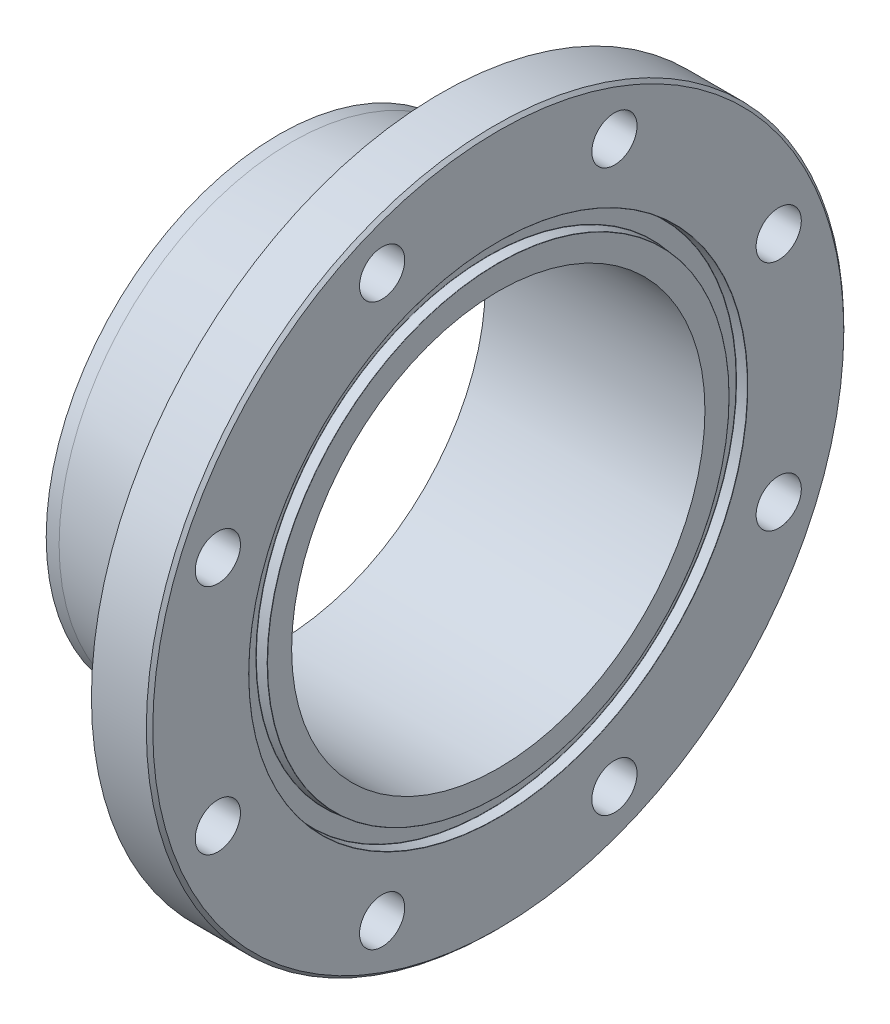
ISO-10303-21;
HEADER;
FILE_DESCRIPTION(('STEP AP214'),'2;1');
FILE_NAME('part.step','',(''),(''),'','','');
FILE_SCHEMA(('AUTOMOTIVE_DESIGN { 1 0 10303 214 1 1 1 1 }'));
ENDSEC;
DATA;
#1=APPLICATION_CONTEXT('core data for automotive mechanical design processes');
#2=APPLICATION_PROTOCOL_DEFINITION('international standard','automotive_design',2000,#1);
#3=PRODUCT_CONTEXT('',#1,'mechanical');
#4=PRODUCT('Part','Part','',(#3));
#5=PRODUCT_RELATED_PRODUCT_CATEGORY('part','',(#4));
#6=PRODUCT_DEFINITION_FORMATION('','',#4);
#7=PRODUCT_DEFINITION_CONTEXT('part definition',#1,'design');
#8=PRODUCT_DEFINITION('design','',#6,#7);
#9=PRODUCT_DEFINITION_SHAPE('','',#8);
#10=(LENGTH_UNIT() NAMED_UNIT(*) SI_UNIT(.MILLI.,.METRE.));
#11=(NAMED_UNIT(*) PLANE_ANGLE_UNIT() SI_UNIT($,.RADIAN.));
#12=(NAMED_UNIT(*) SI_UNIT($,.STERADIAN.) SOLID_ANGLE_UNIT());
#13=UNCERTAINTY_MEASURE_WITH_UNIT(LENGTH_MEASURE(1.E-05),#10,'distance_accuracy_value','');
#14=(GEOMETRIC_REPRESENTATION_CONTEXT(3) GLOBAL_UNCERTAINTY_ASSIGNED_CONTEXT((#13)) GLOBAL_UNIT_ASSIGNED_CONTEXT((#10,
#11,#12)) REPRESENTATION_CONTEXT('',''));
#15=CARTESIAN_POINT('',(0.,0.,0.));
#16=DIRECTION('',(0.,0.,1.));
#17=DIRECTION('',(1.,0.,0.));
#18=AXIS2_PLACEMENT_3D('',#15,#16,#17);
#19=CARTESIAN_POINT('',(0.,0.,-114.3));
#20=DIRECTION('',(1.,0.,0.));
#21=DIRECTION('',(0.,0.,-1.));
#22=AXIS2_PLACEMENT_3D('',#19,#20,#21);
#23=PLANE('',#22);
#24=CARTESIAN_POINT('',(0.,0.,0.));
#25=DIRECTION('',(-1.,0.,0.));
#26=DIRECTION('',(0.,0.,1.));
#27=AXIS2_PLACEMENT_3D('',#24,#25,#26);
#28=CIRCLE('',#27,101.6);
#29=CARTESIAN_POINT('',(0.,0.,101.6));
#30=VERTEX_POINT('',#29);
#31=EDGE_CURVE('E53',#30,#30,#28,.T.);
#32=ORIENTED_EDGE('',*,*,#31,.F.);
#33=EDGE_LOOP('',(#32));
#34=FACE_BOUND('',#33,.T.);
#35=CARTESIAN_POINT('',(0.,0.,0.));
#36=DIRECTION('',(-1.,0.,0.));
#37=DIRECTION('',(0.,0.,1.));
#38=AXIS2_PLACEMENT_3D('',#35,#36,#37);
#39=CIRCLE('',#38,114.3);
#40=CARTESIAN_POINT('',(0.,0.,114.3));
#41=VERTEX_POINT('',#40);
#42=EDGE_CURVE('E102',#41,#41,#39,.T.);
#43=ORIENTED_EDGE('',*,*,#42,.T.);
#44=EDGE_LOOP('',(#43));
#45=FACE_BOUND('',#44,.T.);
#46=ADVANCED_FACE('F33',(#34,#45),#23,.F.);
#47=CARTESIAN_POINT('',(0.,0.,0.));
#48=DIRECTION('',(-1.,0.,0.));
#49=DIRECTION('',(0.,0.,1.));
#50=AXIS2_PLACEMENT_3D('',#47,#48,#49);
#51=CYLINDRICAL_SURFACE('',#50,101.6);
#52=CARTESIAN_POINT('',(107.95,0.,0.));
#53=DIRECTION('',(-1.,0.,0.));
#54=DIRECTION('',(0.,0.,1.));
#55=AXIS2_PLACEMENT_3D('',#52,#53,#54);
#56=CIRCLE('',#55,101.6);
#57=CARTESIAN_POINT('',(107.95,0.,101.6));
#58=VERTEX_POINT('',#57);
#59=EDGE_CURVE('E69',#58,#58,#56,.T.);
#60=ORIENTED_EDGE('',*,*,#59,.F.);
#61=EDGE_LOOP('',(#60));
#62=FACE_BOUND('',#61,.T.);
#63=ORIENTED_EDGE('',*,*,#31,.T.);
#64=EDGE_LOOP('',(#63));
#65=FACE_BOUND('',#64,.T.);
#66=ADVANCED_FACE('F210',(#62,#65),#51,.F.);
#67=CARTESIAN_POINT('',(107.95,0.,-101.6));
#68=DIRECTION('',(-1.,0.,0.));
#69=DIRECTION('',(0.,0.,1.));
#70=AXIS2_PLACEMENT_3D('',#67,#68,#69);
#71=PLANE('',#70);
#72=CARTESIAN_POINT('',(107.95,0.,0.));
#73=DIRECTION('',(-1.,0.,0.));
#74=DIRECTION('',(0.,0.,1.));
#75=AXIS2_PLACEMENT_3D('',#72,#73,#74);
#76=CIRCLE('',#75,113.419461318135);
#77=CARTESIAN_POINT('',(107.95,0.,113.419461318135));
#78=VERTEX_POINT('',#77);
#79=EDGE_CURVE('E72',#78,#78,#76,.T.);
#80=ORIENTED_EDGE('',*,*,#79,.F.);
#81=EDGE_LOOP('',(#80));
#82=FACE_BOUND('',#81,.T.);
#83=ORIENTED_EDGE('',*,*,#59,.T.);
#84=EDGE_LOOP('',(#83));
#85=FACE_BOUND('',#84,.T.);
#86=ADVANCED_FACE('F204',(#82,#85),#71,.F.);
#87=CARTESIAN_POINT('',(107.823,0.,0.));
#88=DIRECTION('',(-1.,0.,0.));
#89=DIRECTION('',(0.,0.,1.));
#90=AXIS2_PLACEMENT_3D('',#87,#88,#89);
#91=TOROIDAL_SURFACE('',#90,113.419461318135,0.127000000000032);
#92=CARTESIAN_POINT('',(107.834068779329,0.,0.));
#93=DIRECTION('',(-1.,0.,0.));
#94=DIRECTION('',(0.,0.,1.));
#95=AXIS2_PLACEMENT_3D('',#92,#93,#94);
#96=CIRCLE('',#95,113.545978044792);
#97=CARTESIAN_POINT('',(107.834068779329,0.,113.545978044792));
#98=VERTEX_POINT('',#97);
#99=EDGE_CURVE('E75',#98,#98,#96,.T.);
#100=ORIENTED_EDGE('',*,*,#99,.F.);
#101=EDGE_LOOP('',(#100));
#102=FACE_BOUND('',#101,.T.);
#103=ORIENTED_EDGE('',*,*,#79,.T.);
#104=EDGE_LOOP('',(#103));
#105=FACE_BOUND('',#104,.T.);
#106=ADVANCED_FACE('F198',(#102,#105),#91,.T.);
#107=CARTESIAN_POINT('',(107.834068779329,0.,0.));
#108=DIRECTION('',(-1.,0.,0.));
#109=DIRECTION('',(0.,0.,1.));
#110=AXIS2_PLACEMENT_3D('',#107,#108,#109);
#111=CONICAL_SURFACE('',#110,113.545978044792,0.087266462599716);
#112=CARTESIAN_POINT('',(102.960531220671,0.,0.));
#113=DIRECTION('',(-1.,0.,0.));
#114=DIRECTION('',(0.,0.,1.));
#115=AXIS2_PLACEMENT_3D('',#112,#113,#114);
#116=CIRCLE('',#115,113.972357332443);
#117=CARTESIAN_POINT('',(102.960531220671,0.,113.972357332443));
#118=VERTEX_POINT('',#117);
#119=EDGE_CURVE('E78',#118,#118,#116,.T.);
#120=ORIENTED_EDGE('',*,*,#119,.F.);
#121=EDGE_LOOP('',(#120));
#122=FACE_BOUND('',#121,.T.);
#123=ORIENTED_EDGE('',*,*,#99,.T.);
#124=EDGE_LOOP('',(#123));
#125=FACE_BOUND('',#124,.T.);
#126=ADVANCED_FACE('F192',(#122,#125),#111,.T.);
#127=CARTESIAN_POINT('',(102.9716,0.,0.));
#128=DIRECTION('',(-1.,0.,0.));
#129=DIRECTION('',(0.,0.,1.));
#130=AXIS2_PLACEMENT_3D('',#127,#128,#129);
#131=TOROIDAL_SURFACE('',#130,114.0988740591,0.127000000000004);
#132=CARTESIAN_POINT('',(102.8446,0.,0.));
#133=DIRECTION('',(-1.,0.,0.));
#134=DIRECTION('',(0.,0.,1.));
#135=AXIS2_PLACEMENT_3D('',#132,#133,#134);
#136=CIRCLE('',#135,114.0988740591);
#137=CARTESIAN_POINT('',(102.8446,0.,114.0988740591));
#138=VERTEX_POINT('',#137);
#139=EDGE_CURVE('E81',#138,#138,#136,.T.);
#140=ORIENTED_EDGE('',*,*,#139,.F.);
#141=EDGE_LOOP('',(#140));
#142=FACE_BOUND('',#141,.T.);
#143=ORIENTED_EDGE('',*,*,#119,.T.);
#144=EDGE_LOOP('',(#143));
#145=FACE_BOUND('',#144,.T.);
#146=ADVANCED_FACE('F186',(#142,#145),#131,.F.);
#147=CARTESIAN_POINT('',(102.8446,0.,-114.0988740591));
#148=DIRECTION('',(-1.,0.,0.));
#149=DIRECTION('',(0.,0.,1.));
#150=AXIS2_PLACEMENT_3D('',#147,#148,#149);
#151=PLANE('',#150);
#152=CARTESIAN_POINT('',(102.8446,0.,0.));
#153=DIRECTION('',(-1.,0.,0.));
#154=DIRECTION('',(0.,0.,1.));
#155=AXIS2_PLACEMENT_3D('',#152,#153,#154);
#156=CIRCLE('',#155,122.0449259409);
#157=CARTESIAN_POINT('',(102.8446,0.,122.0449259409));
#158=VERTEX_POINT('',#157);
#159=EDGE_CURVE('E84',#158,#158,#156,.T.);
#160=ORIENTED_EDGE('',*,*,#159,.F.);
#161=EDGE_LOOP('',(#160));
#162=FACE_BOUND('',#161,.T.);
#163=ORIENTED_EDGE('',*,*,#139,.T.);
#164=EDGE_LOOP('',(#163));
#165=FACE_BOUND('',#164,.T.);
#166=ADVANCED_FACE('F180',(#162,#165),#151,.F.);
#167=CARTESIAN_POINT('',(102.9716,0.,0.));
#168=DIRECTION('',(-1.,0.,0.));
#169=DIRECTION('',(0.,0.,1.));
#170=AXIS2_PLACEMENT_3D('',#167,#168,#169);
#171=TOROIDAL_SURFACE('',#170,122.0449259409,0.127000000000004);
#172=CARTESIAN_POINT('',(102.960531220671,0.,0.));
#173=DIRECTION('',(-1.,0.,0.));
#174=DIRECTION('',(0.,0.,1.));
#175=AXIS2_PLACEMENT_3D('',#172,#173,#174);
#176=CIRCLE('',#175,122.171442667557);
#177=CARTESIAN_POINT('',(102.960531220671,0.,122.171442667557));
#178=VERTEX_POINT('',#177);
#179=EDGE_CURVE('E87',#178,#178,#176,.T.);
#180=ORIENTED_EDGE('',*,*,#179,.F.);
#181=EDGE_LOOP('',(#180));
#182=FACE_BOUND('',#181,.T.);
#183=ORIENTED_EDGE('',*,*,#159,.T.);
#184=EDGE_LOOP('',(#183));
#185=FACE_BOUND('',#184,.T.);
#186=ADVANCED_FACE('F174',(#182,#185),#171,.F.);
#187=CARTESIAN_POINT('',(102.960531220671,0.,0.));
#188=DIRECTION('',(1.,0.,0.));
#189=DIRECTION('',(0.,0.,-1.));
#190=AXIS2_PLACEMENT_3D('',#187,#188,#189);
#191=CONICAL_SURFACE('',#190,122.171442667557,0.0872664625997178);
#192=CARTESIAN_POINT('',(107.834068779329,0.,0.));
#193=DIRECTION('',(-1.,0.,0.));
#194=DIRECTION('',(0.,0.,1.));
#195=AXIS2_PLACEMENT_3D('',#192,#193,#194);
#196=CIRCLE('',#195,122.597821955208);
#197=CARTESIAN_POINT('',(107.834068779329,0.,122.597821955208));
#198=VERTEX_POINT('',#197);
#199=EDGE_CURVE('E90',#198,#198,#196,.T.);
#200=ORIENTED_EDGE('',*,*,#199,.F.);
#201=EDGE_LOOP('',(#200));
#202=FACE_BOUND('',#201,.T.);
#203=ORIENTED_EDGE('',*,*,#179,.T.);
#204=EDGE_LOOP('',(#203));
#205=FACE_BOUND('',#204,.T.);
#206=ADVANCED_FACE('F168',(#202,#205),#191,.F.);
#207=CARTESIAN_POINT('',(107.823,0.,0.));
#208=DIRECTION('',(-1.,0.,0.));
#209=DIRECTION('',(0.,0.,1.));
#210=AXIS2_PLACEMENT_3D('',#207,#208,#209);
#211=TOROIDAL_SURFACE('',#210,122.724338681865,0.127000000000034);
#212=CARTESIAN_POINT('',(107.95,0.,0.));
#213=DIRECTION('',(-1.,0.,0.));
#214=DIRECTION('',(0.,0.,1.));
#215=AXIS2_PLACEMENT_3D('',#212,#213,#214);
#216=CIRCLE('',#215,122.724338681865);
#217=CARTESIAN_POINT('',(107.95,0.,122.724338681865));
#218=VERTEX_POINT('',#217);
#219=EDGE_CURVE('E93',#218,#218,#216,.T.);
#220=ORIENTED_EDGE('',*,*,#219,.F.);
#221=EDGE_LOOP('',(#220));
#222=FACE_BOUND('',#221,.T.);
#223=ORIENTED_EDGE('',*,*,#199,.T.);
#224=EDGE_LOOP('',(#223));
#225=FACE_BOUND('',#224,.T.);
#226=ADVANCED_FACE('F148',(#222,#225),#211,.T.);
#227=CARTESIAN_POINT('',(107.95,0.,-122.724338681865));
#228=DIRECTION('',(-1.,0.,0.));
#229=DIRECTION('',(0.,0.,1.));
#230=AXIS2_PLACEMENT_3D('',#227,#228,#229);
#231=PLANE('',#230);
#232=CARTESIAN_POINT('',(107.95,0.,0.));
#233=DIRECTION('',(-1.,0.,0.));
#234=DIRECTION('',(0.,0.,1.));
#235=AXIS2_PLACEMENT_3D('',#232,#233,#234);
#236=CIRCLE('',#235,169.8625);
#237=CARTESIAN_POINT('',(107.95,0.,169.8625));
#238=VERTEX_POINT('',#237);
#239=EDGE_CURVE('E10',#238,#238,#236,.F.);
#240=ORIENTED_EDGE('',*,*,#239,.T.);
#241=EDGE_LOOP('',(#240));
#242=FACE_BOUND('',#241,.T.);
#243=CARTESIAN_POINT('',(107.95,137.865923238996,57.1059351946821));
#244=DIRECTION('',(1.,0.,0.));
#245=DIRECTION('',(0.,0.,-1.));
#246=AXIS2_PLACEMENT_3D('',#243,#244,#245);
#247=CIRCLE('',#246,11.1125);
#248=CARTESIAN_POINT('',(107.95,137.865923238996,45.9934351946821));
#249=VERTEX_POINT('',#248);
#250=EDGE_CURVE('E58',#249,#249,#247,.T.);
#251=ORIENTED_EDGE('',*,*,#250,.F.);
#252=EDGE_LOOP('',(#251));
#253=FACE_BOUND('',#252,.T.);
#254=CARTESIAN_POINT('',(107.95,137.865923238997,-57.1059351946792));
#255=DIRECTION('',(1.,0.,0.));
#256=DIRECTION('',(0.,0.,-1.));
#257=AXIS2_PLACEMENT_3D('',#254,#255,#256);
#258=CIRCLE('',#257,11.1125);
#259=CARTESIAN_POINT('',(107.95,137.865923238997,-68.2184351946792));
#260=VERTEX_POINT('',#259);
#261=EDGE_CURVE('E57',#260,#260,#258,.T.);
#262=ORIENTED_EDGE('',*,*,#261,.F.);
#263=EDGE_LOOP('',(#262));
#264=FACE_BOUND('',#263,.T.);
#265=CARTESIAN_POINT('',(107.95,57.1059351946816,-137.865923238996));
#266=DIRECTION('',(1.,0.,0.));
#267=DIRECTION('',(0.,0.,-1.));
#268=AXIS2_PLACEMENT_3D('',#265,#266,#267);
#269=CIRCLE('',#268,11.1125);
#270=CARTESIAN_POINT('',(107.95,57.1059351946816,-148.978423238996));
#271=VERTEX_POINT('',#270);
#272=EDGE_CURVE('E62',#271,#271,#269,.T.);
#273=ORIENTED_EDGE('',*,*,#272,.F.);
#274=EDGE_LOOP('',(#273));
#275=FACE_BOUND('',#274,.T.);
#276=CARTESIAN_POINT('',(107.95,-57.1059351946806,-137.865923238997));
#277=DIRECTION('',(1.,0.,0.));
#278=DIRECTION('',(0.,0.,-1.));
#279=AXIS2_PLACEMENT_3D('',#276,#277,#278);
#280=CIRCLE('',#279,11.1125);
#281=CARTESIAN_POINT('',(107.95,-57.1059351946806,-148.978423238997));
#282=VERTEX_POINT('',#281);
#283=EDGE_CURVE('E66',#282,#282,#280,.T.);
#284=ORIENTED_EDGE('',*,*,#283,.F.);
#285=EDGE_LOOP('',(#284));
#286=FACE_BOUND('',#285,.T.);
#287=CARTESIAN_POINT('',(107.95,-137.865923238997,-57.1059351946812));
#288=DIRECTION('',(1.,0.,0.));
#289=DIRECTION('',(0.,0.,-1.));
#290=AXIS2_PLACEMENT_3D('',#287,#288,#289);
#291=CIRCLE('',#290,11.1125);
#292=CARTESIAN_POINT('',(107.95,-137.865923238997,-68.2184351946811));
#293=VERTEX_POINT('',#292);
#294=EDGE_CURVE('E126',#293,#293,#291,.T.);
#295=ORIENTED_EDGE('',*,*,#294,.F.);
#296=EDGE_LOOP('',(#295));
#297=FACE_BOUND('',#296,.T.);
#298=CARTESIAN_POINT('',(107.95,-137.865923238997,57.1059351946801));
#299=DIRECTION('',(1.,0.,0.));
#300=DIRECTION('',(0.,0.,-1.));
#301=AXIS2_PLACEMENT_3D('',#298,#299,#300);
#302=CIRCLE('',#301,11.1125);
#303=CARTESIAN_POINT('',(107.95,-137.865923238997,45.9934351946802));
#304=VERTEX_POINT('',#303);
#305=EDGE_CURVE('E120',#304,#304,#302,.T.);
#306=ORIENTED_EDGE('',*,*,#305,.F.);
#307=EDGE_LOOP('',(#306));
#308=FACE_BOUND('',#307,.T.);
#309=CARTESIAN_POINT('',(107.95,-57.1059351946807,137.865923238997));
#310=DIRECTION('',(1.,0.,0.));
#311=DIRECTION('',(0.,0.,-1.));
#312=AXIS2_PLACEMENT_3D('',#309,#310,#311);
#313=CIRCLE('',#312,11.1125);
#314=CARTESIAN_POINT('',(107.95,-57.1059351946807,126.753423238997));
#315=VERTEX_POINT('',#314);
#316=EDGE_CURVE('E114',#315,#315,#313,.T.);
#317=ORIENTED_EDGE('',*,*,#316,.F.);
#318=EDGE_LOOP('',(#317));
#319=FACE_BOUND('',#318,.T.);
#320=CARTESIAN_POINT('',(107.95,57.1059351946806,137.865923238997));
#321=DIRECTION('',(1.,0.,0.));
#322=DIRECTION('',(0.,0.,-1.));
#323=AXIS2_PLACEMENT_3D('',#320,#321,#322);
#324=CIRCLE('',#323,11.1125);
#325=CARTESIAN_POINT('',(107.95,57.1059351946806,126.753423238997));
#326=VERTEX_POINT('',#325);
#327=EDGE_CURVE('E108',#326,#326,#324,.T.);
#328=ORIENTED_EDGE('',*,*,#327,.F.);
#329=EDGE_LOOP('',(#328));
#330=FACE_BOUND('',#329,.T.);
#331=ORIENTED_EDGE('',*,*,#219,.T.);
#332=EDGE_LOOP('',(#331));
#333=FACE_BOUND('',#332,.T.);
#334=ADVANCED_FACE('F144',(#242,#253,#264,#275,#286,#297,#308,#319,#330,#333),#231,.F.);
#335=CARTESIAN_POINT('',(0.,0.,0.));
#336=DIRECTION('',(-1.,0.,0.));
#337=DIRECTION('',(0.,0.,1.));
#338=AXIS2_PLACEMENT_3D('',#335,#336,#337);
#339=CYLINDRICAL_SURFACE('',#338,171.45);
#340=CARTESIAN_POINT('',(106.3625,0.,0.));
#341=DIRECTION('',(-1.,0.,0.));
#342=DIRECTION('',(0.,0.,1.));
#343=AXIS2_PLACEMENT_3D('',#340,#341,#342);
#344=CIRCLE('',#343,171.45);
#345=CARTESIAN_POINT('',(106.3625,0.,171.45));
#346=VERTEX_POINT('',#345);
#347=EDGE_CURVE('E40',#346,#346,#344,.T.);
#348=ORIENTED_EDGE('',*,*,#347,.T.);
#349=EDGE_LOOP('',(#348));
#350=FACE_BOUND('',#349,.T.);
#351=CARTESIAN_POINT('',(79.375,0.,0.));
#352=DIRECTION('',(-1.,0.,0.));
#353=DIRECTION('',(0.,0.,1.));
#354=AXIS2_PLACEMENT_3D('',#351,#352,#353);
#355=CIRCLE('',#354,171.45);
#356=CARTESIAN_POINT('',(79.375,0.,171.45));
#357=VERTEX_POINT('',#356);
#358=EDGE_CURVE('E96',#357,#357,#355,.T.);
#359=ORIENTED_EDGE('',*,*,#358,.F.);
#360=EDGE_LOOP('',(#359));
#361=FACE_BOUND('',#360,.T.);
#362=ADVANCED_FACE('F147',(#350,#361),#339,.T.);
#363=CARTESIAN_POINT('',(79.375,0.,-171.45));
#364=DIRECTION('',(1.,0.,0.));
#365=DIRECTION('',(0.,0.,-1.));
#366=AXIS2_PLACEMENT_3D('',#363,#364,#365);
#367=PLANE('',#366);
#368=CARTESIAN_POINT('',(79.375,0.,0.));
#369=DIRECTION('',(1.,0.,0.));
#370=DIRECTION('',(0.,0.,-1.));
#371=AXIS2_PLACEMENT_3D('',#368,#369,#370);
#372=CIRCLE('',#371,132.188292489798);
#373=CARTESIAN_POINT('',(79.375,0.,-132.188292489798));
#374=VERTEX_POINT('',#373);
#375=EDGE_CURVE('E44',#374,#374,#372,.T.);
#376=ORIENTED_EDGE('',*,*,#375,.T.);
#377=EDGE_LOOP('',(#376));
#378=FACE_BOUND('',#377,.T.);
#379=CARTESIAN_POINT('',(79.375,137.865923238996,57.1059351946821));
#380=DIRECTION('',(1.,0.,0.));
#381=DIRECTION('',(0.,0.,-1.));
#382=AXIS2_PLACEMENT_3D('',#379,#380,#381);
#383=CIRCLE('',#382,11.1125);
#384=CARTESIAN_POINT('',(79.375,137.865923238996,45.9934351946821));
#385=VERTEX_POINT('',#384);
#386=EDGE_CURVE('E54',#385,#385,#383,.T.);
#387=ORIENTED_EDGE('',*,*,#386,.T.);
#388=EDGE_LOOP('',(#387));
#389=FACE_BOUND('',#388,.T.);
#390=CARTESIAN_POINT('',(79.375,137.865923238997,-57.1059351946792));
#391=DIRECTION('',(1.,0.,0.));
#392=DIRECTION('',(0.,0.,-1.));
#393=AXIS2_PLACEMENT_3D('',#390,#391,#392);
#394=CIRCLE('',#393,11.1125);
#395=CARTESIAN_POINT('',(79.375,137.865923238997,-68.2184351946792));
#396=VERTEX_POINT('',#395);
#397=EDGE_CURVE('E59',#396,#396,#394,.T.);
#398=ORIENTED_EDGE('',*,*,#397,.T.);
#399=EDGE_LOOP('',(#398));
#400=FACE_BOUND('',#399,.T.);
#401=CARTESIAN_POINT('',(79.375,57.1059351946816,-137.865923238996));
#402=DIRECTION('',(1.,0.,0.));
#403=DIRECTION('',(0.,0.,-1.));
#404=AXIS2_PLACEMENT_3D('',#401,#402,#403);
#405=CIRCLE('',#404,11.1125);
#406=CARTESIAN_POINT('',(79.375,57.1059351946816,-148.978423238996));
#407=VERTEX_POINT('',#406);
#408=EDGE_CURVE('E63',#407,#407,#405,.T.);
#409=ORIENTED_EDGE('',*,*,#408,.T.);
#410=EDGE_LOOP('',(#409));
#411=FACE_BOUND('',#410,.T.);
#412=CARTESIAN_POINT('',(79.375,-57.1059351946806,-137.865923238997));
#413=DIRECTION('',(1.,0.,0.));
#414=DIRECTION('',(0.,0.,-1.));
#415=AXIS2_PLACEMENT_3D('',#412,#413,#414);
#416=CIRCLE('',#415,11.1125);
#417=CARTESIAN_POINT('',(79.375,-57.1059351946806,-148.978423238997));
#418=VERTEX_POINT('',#417);
#419=EDGE_CURVE('E129',#418,#418,#416,.T.);
#420=ORIENTED_EDGE('',*,*,#419,.T.);
#421=EDGE_LOOP('',(#420));
#422=FACE_BOUND('',#421,.T.);
#423=CARTESIAN_POINT('',(79.375,-137.865923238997,-57.1059351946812));
#424=DIRECTION('',(1.,0.,0.));
#425=DIRECTION('',(0.,0.,-1.));
#426=AXIS2_PLACEMENT_3D('',#423,#424,#425);
#427=CIRCLE('',#426,11.1125);
#428=CARTESIAN_POINT('',(79.375,-137.865923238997,-68.2184351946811));
#429=VERTEX_POINT('',#428);
#430=EDGE_CURVE('E123',#429,#429,#427,.T.);
#431=ORIENTED_EDGE('',*,*,#430,.T.);
#432=EDGE_LOOP('',(#431));
#433=FACE_BOUND('',#432,.T.);
#434=CARTESIAN_POINT('',(79.375,-137.865923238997,57.1059351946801));
#435=DIRECTION('',(1.,0.,0.));
#436=DIRECTION('',(0.,0.,-1.));
#437=AXIS2_PLACEMENT_3D('',#434,#435,#436);
#438=CIRCLE('',#437,11.1125);
#439=CARTESIAN_POINT('',(79.375,-137.865923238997,45.9934351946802));
#440=VERTEX_POINT('',#439);
#441=EDGE_CURVE('E117',#440,#440,#438,.T.);
#442=ORIENTED_EDGE('',*,*,#441,.T.);
#443=EDGE_LOOP('',(#442));
#444=FACE_BOUND('',#443,.T.);
#445=CARTESIAN_POINT('',(79.375,-57.1059351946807,137.865923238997));
#446=DIRECTION('',(1.,0.,0.));
#447=DIRECTION('',(0.,0.,-1.));
#448=AXIS2_PLACEMENT_3D('',#445,#446,#447);
#449=CIRCLE('',#448,11.1125);
#450=CARTESIAN_POINT('',(79.375,-57.1059351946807,126.753423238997));
#451=VERTEX_POINT('',#450);
#452=EDGE_CURVE('E111',#451,#451,#449,.T.);
#453=ORIENTED_EDGE('',*,*,#452,.T.);
#454=EDGE_LOOP('',(#453));
#455=FACE_BOUND('',#454,.T.);
#456=CARTESIAN_POINT('',(79.375,57.1059351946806,137.865923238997));
#457=DIRECTION('',(1.,0.,0.));
#458=DIRECTION('',(0.,0.,-1.));
#459=AXIS2_PLACEMENT_3D('',#456,#457,#458);
#460=CIRCLE('',#459,11.1125);
#461=CARTESIAN_POINT('',(79.375,57.1059351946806,126.753423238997));
#462=VERTEX_POINT('',#461);
#463=EDGE_CURVE('E105',#462,#462,#460,.T.);
#464=ORIENTED_EDGE('',*,*,#463,.T.);
#465=EDGE_LOOP('',(#464));
#466=FACE_BOUND('',#465,.T.);
#467=ORIENTED_EDGE('',*,*,#358,.T.);
#468=EDGE_LOOP('',(#467));
#469=FACE_BOUND('',#468,.T.);
#470=ADVANCED_FACE('F233',(#378,#389,#400,#411,#422,#433,#444,#455,#466,#469),#367,.F.);
#471=CARTESIAN_POINT('',(79.375,0.,0.));
#472=DIRECTION('',(1.,0.,0.));
#473=DIRECTION('',(0.,0.,-1.));
#474=AXIS2_PLACEMENT_3D('',#471,#472,#473);
#475=CONICAL_SURFACE('',#474,123.825,0.129702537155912);
#476=CARTESIAN_POINT('',(71.0819557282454,0.,0.));
#477=DIRECTION('',(1.,0.,0.));
#478=DIRECTION('',(0.,0.,-1.));
#479=AXIS2_PLACEMENT_3D('',#476,#477,#478);
#480=CIRCLE('',#479,122.743298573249);
#481=CARTESIAN_POINT('',(71.0819557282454,0.,-122.743298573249));
#482=VERTEX_POINT('',#481);
#483=EDGE_CURVE('E48',#482,#482,#480,.F.);
#484=ORIENTED_EDGE('',*,*,#483,.T.);
#485=EDGE_LOOP('',(#484));
#486=FACE_BOUND('',#485,.T.);
#487=CARTESIAN_POINT('',(6.35,0.,0.));
#488=DIRECTION('',(-1.,0.,0.));
#489=DIRECTION('',(0.,0.,1.));
#490=AXIS2_PLACEMENT_3D('',#487,#488,#489);
#491=CIRCLE('',#490,114.3);
#492=CARTESIAN_POINT('',(6.35,0.,114.3));
#493=VERTEX_POINT('',#492);
#494=EDGE_CURVE('E99',#493,#493,#491,.T.);
#495=ORIENTED_EDGE('',*,*,#494,.F.);
#496=EDGE_LOOP('',(#495));
#497=FACE_BOUND('',#496,.T.);
#498=ADVANCED_FACE('F228',(#486,#497),#475,.T.);
#499=CARTESIAN_POINT('',(0.,0.,0.));
#500=DIRECTION('',(-1.,0.,0.));
#501=DIRECTION('',(0.,0.,1.));
#502=AXIS2_PLACEMENT_3D('',#499,#500,#501);
#503=CYLINDRICAL_SURFACE('',#502,114.3);
#504=ORIENTED_EDGE('',*,*,#42,.F.);
#505=EDGE_LOOP('',(#504));
#506=FACE_BOUND('',#505,.T.);
#507=ORIENTED_EDGE('',*,*,#494,.T.);
#508=EDGE_LOOP('',(#507));
#509=FACE_BOUND('',#508,.T.);
#510=ADVANCED_FACE('F224',(#506,#509),#503,.T.);
#511=CARTESIAN_POINT('',(107.95,57.1059351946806,137.865923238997));
#512=DIRECTION('',(1.,0.,0.));
#513=DIRECTION('',(0.,0.,-1.));
#514=AXIS2_PLACEMENT_3D('',#511,#512,#513);
#515=CYLINDRICAL_SURFACE('',#514,11.1125);
#516=ORIENTED_EDGE('',*,*,#327,.T.);
#517=EDGE_LOOP('',(#516));
#518=FACE_BOUND('',#517,.T.);
#519=ORIENTED_EDGE('',*,*,#463,.F.);
#520=EDGE_LOOP('',(#519));
#521=FACE_BOUND('',#520,.T.);
#522=ADVANCED_FACE('F227',(#518,#521),#515,.F.);
#523=CARTESIAN_POINT('',(107.95,-57.1059351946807,137.865923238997));
#524=DIRECTION('',(1.,0.,0.));
#525=DIRECTION('',(0.,0.,-1.));
#526=AXIS2_PLACEMENT_3D('',#523,#524,#525);
#527=CYLINDRICAL_SURFACE('',#526,11.1125);
#528=ORIENTED_EDGE('',*,*,#316,.T.);
#529=EDGE_LOOP('',(#528));
#530=FACE_BOUND('',#529,.T.);
#531=ORIENTED_EDGE('',*,*,#452,.F.);
#532=EDGE_LOOP('',(#531));
#533=FACE_BOUND('',#532,.T.);
#534=ADVANCED_FACE('F278',(#530,#533),#527,.F.);
#535=CARTESIAN_POINT('',(107.95,-137.865923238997,57.1059351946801));
#536=DIRECTION('',(1.,0.,0.));
#537=DIRECTION('',(0.,0.,-1.));
#538=AXIS2_PLACEMENT_3D('',#535,#536,#537);
#539=CYLINDRICAL_SURFACE('',#538,11.1125);
#540=ORIENTED_EDGE('',*,*,#305,.T.);
#541=EDGE_LOOP('',(#540));
#542=FACE_BOUND('',#541,.T.);
#543=ORIENTED_EDGE('',*,*,#441,.F.);
#544=EDGE_LOOP('',(#543));
#545=FACE_BOUND('',#544,.T.);
#546=ADVANCED_FACE('F283',(#542,#545),#539,.F.);
#547=CARTESIAN_POINT('',(107.95,-137.865923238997,-57.1059351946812));
#548=DIRECTION('',(1.,0.,0.));
#549=DIRECTION('',(0.,0.,-1.));
#550=AXIS2_PLACEMENT_3D('',#547,#548,#549);
#551=CYLINDRICAL_SURFACE('',#550,11.1125);
#552=ORIENTED_EDGE('',*,*,#294,.T.);
#553=EDGE_LOOP('',(#552));
#554=FACE_BOUND('',#553,.T.);
#555=ORIENTED_EDGE('',*,*,#430,.F.);
#556=EDGE_LOOP('',(#555));
#557=FACE_BOUND('',#556,.T.);
#558=ADVANCED_FACE('F289',(#554,#557),#551,.F.);
#559=CARTESIAN_POINT('',(107.95,-57.1059351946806,-137.865923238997));
#560=DIRECTION('',(1.,0.,0.));
#561=DIRECTION('',(0.,0.,-1.));
#562=AXIS2_PLACEMENT_3D('',#559,#560,#561);
#563=CYLINDRICAL_SURFACE('',#562,11.1125);
#564=ORIENTED_EDGE('',*,*,#283,.T.);
#565=EDGE_LOOP('',(#564));
#566=FACE_BOUND('',#565,.T.);
#567=ORIENTED_EDGE('',*,*,#419,.F.);
#568=EDGE_LOOP('',(#567));
#569=FACE_BOUND('',#568,.T.);
#570=ADVANCED_FACE('F293',(#566,#569),#563,.F.);
#571=CARTESIAN_POINT('',(107.95,57.1059351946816,-137.865923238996));
#572=DIRECTION('',(1.,0.,0.));
#573=DIRECTION('',(0.,0.,-1.));
#574=AXIS2_PLACEMENT_3D('',#571,#572,#573);
#575=CYLINDRICAL_SURFACE('',#574,11.1125);
#576=ORIENTED_EDGE('',*,*,#272,.T.);
#577=EDGE_LOOP('',(#576));
#578=FACE_BOUND('',#577,.T.);
#579=ORIENTED_EDGE('',*,*,#408,.F.);
#580=EDGE_LOOP('',(#579));
#581=FACE_BOUND('',#580,.T.);
#582=ADVANCED_FACE('F297',(#578,#581),#575,.F.);
#583=CARTESIAN_POINT('',(107.95,137.865923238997,-57.1059351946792));
#584=DIRECTION('',(1.,0.,0.));
#585=DIRECTION('',(0.,0.,-1.));
#586=AXIS2_PLACEMENT_3D('',#583,#584,#585);
#587=CYLINDRICAL_SURFACE('',#586,11.1125);
#588=ORIENTED_EDGE('',*,*,#261,.T.);
#589=EDGE_LOOP('',(#588));
#590=FACE_BOUND('',#589,.T.);
#591=ORIENTED_EDGE('',*,*,#397,.F.);
#592=EDGE_LOOP('',(#591));
#593=FACE_BOUND('',#592,.T.);
#594=ADVANCED_FACE('F252',(#590,#593),#587,.F.);
#595=CARTESIAN_POINT('',(107.95,137.865923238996,57.1059351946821));
#596=DIRECTION('',(1.,0.,0.));
#597=DIRECTION('',(0.,0.,-1.));
#598=AXIS2_PLACEMENT_3D('',#595,#596,#597);
#599=CYLINDRICAL_SURFACE('',#598,11.1125);
#600=ORIENTED_EDGE('',*,*,#250,.T.);
#601=EDGE_LOOP('',(#600));
#602=FACE_BOUND('',#601,.T.);
#603=ORIENTED_EDGE('',*,*,#386,.F.);
#604=EDGE_LOOP('',(#603));
#605=FACE_BOUND('',#604,.T.);
#606=ADVANCED_FACE('F141',(#602,#605),#599,.F.);
#607=CARTESIAN_POINT('',(69.85,0.,0.));
#608=DIRECTION('',(1.,0.,0.));
#609=DIRECTION('',(0.,0.,-1.));
#610=AXIS2_PLACEMENT_3D('',#607,#608,#609);
#611=TOROIDAL_SURFACE('',#610,132.188292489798,9.525);
#612=ORIENTED_EDGE('',*,*,#375,.F.);
#613=EDGE_LOOP('',(#612));
#614=FACE_BOUND('',#613,.T.);
#615=ORIENTED_EDGE('',*,*,#483,.F.);
#616=EDGE_LOOP('',(#615));
#617=FACE_BOUND('',#616,.T.);
#618=ADVANCED_FACE('F244',(#614,#617),#611,.F.);
#619=CARTESIAN_POINT('',(106.3625,0.,0.));
#620=DIRECTION('',(-1.,0.,0.));
#621=DIRECTION('',(0.,0.,1.));
#622=AXIS2_PLACEMENT_3D('',#619,#620,#621);
#623=CONICAL_SURFACE('',#622,171.45,0.78539816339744);
#624=ORIENTED_EDGE('',*,*,#239,.F.);
#625=EDGE_LOOP('',(#624));
#626=FACE_BOUND('',#625,.T.);
#627=ORIENTED_EDGE('',*,*,#347,.F.);
#628=EDGE_LOOP('',(#627));
#629=FACE_BOUND('',#628,.T.);
#630=ADVANCED_FACE('F35',(#626,#629),#623,.T.);
#631=CLOSED_SHELL('',(#46,#66,#86,#106,#126,#146,#166,#186,#206,#226,#334,#362,#470,#498,#510,
#522,#534,#546,#558,#570,#582,#594,#606,#618,#630));
#632=MANIFOLD_SOLID_BREP('B2',#631);
#633=ADVANCED_BREP_SHAPE_REPRESENTATION('',(#18,#632),#14);
#634=SHAPE_DEFINITION_REPRESENTATION(#9,#633);
ENDSEC;
END-ISO-10303-21;
